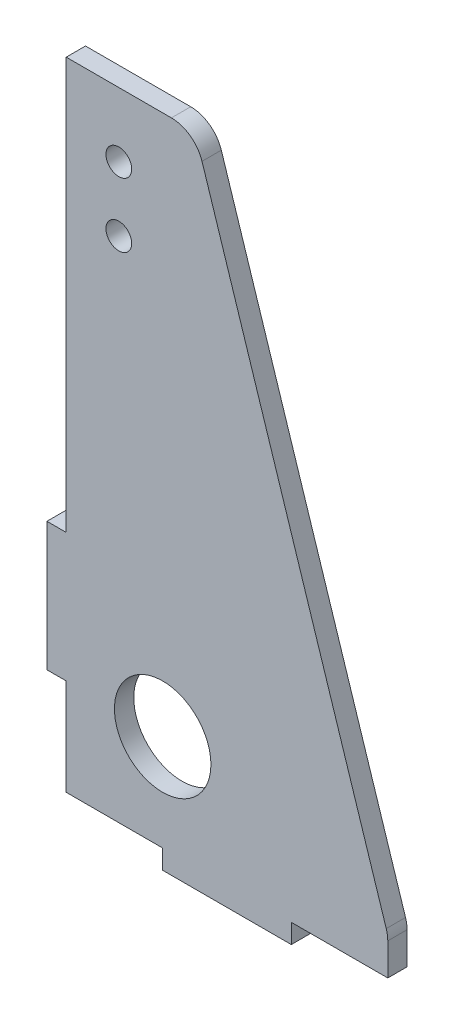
ISO-10303-21;
HEADER;
FILE_DESCRIPTION(('STEP AP214'),'2;1');
FILE_NAME('part.step','',(''),(''),'','','');
FILE_SCHEMA(('AUTOMOTIVE_DESIGN { 1 0 10303 214 1 1 1 1 }'));
ENDSEC;
DATA;
#1=APPLICATION_CONTEXT('core data for automotive mechanical design processes');
#2=APPLICATION_PROTOCOL_DEFINITION('international standard','automotive_design',2000,#1);
#3=PRODUCT_CONTEXT('',#1,'mechanical');
#4=PRODUCT('Part','Part','',(#3));
#5=PRODUCT_RELATED_PRODUCT_CATEGORY('part','',(#4));
#6=PRODUCT_DEFINITION_FORMATION('','',#4);
#7=PRODUCT_DEFINITION_CONTEXT('part definition',#1,'design');
#8=PRODUCT_DEFINITION('design','',#6,#7);
#9=PRODUCT_DEFINITION_SHAPE('','',#8);
#10=(LENGTH_UNIT() NAMED_UNIT(*) SI_UNIT(.MILLI.,.METRE.));
#11=(NAMED_UNIT(*) PLANE_ANGLE_UNIT() SI_UNIT($,.RADIAN.));
#12=(NAMED_UNIT(*) SI_UNIT($,.STERADIAN.) SOLID_ANGLE_UNIT());
#13=UNCERTAINTY_MEASURE_WITH_UNIT(LENGTH_MEASURE(1.E-05),#10,'distance_accuracy_value','');
#14=(GEOMETRIC_REPRESENTATION_CONTEXT(3) GLOBAL_UNCERTAINTY_ASSIGNED_CONTEXT((#13)) GLOBAL_UNIT_ASSIGNED_CONTEXT((#10,
#11,#12)) REPRESENTATION_CONTEXT('',''));
#15=CARTESIAN_POINT('',(0.,0.,0.));
#16=DIRECTION('',(0.,0.,1.));
#17=DIRECTION('',(1.,0.,0.));
#18=AXIS2_PLACEMENT_3D('',#15,#16,#17);
#19=CARTESIAN_POINT('',(16.3566123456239,94.,3.));
#20=DIRECTION('',(0.,0.,-1.));
#21=DIRECTION('',(-1.,0.,0.));
#22=AXIS2_PLACEMENT_3D('',#19,#20,#21);
#23=PLANE('',#22);
#24=DIRECTION('',(1.,0.,0.));
#25=VECTOR('',#24,1.);
#26=CARTESIAN_POINT('',(15.,0.,3.));
#27=LINE('',#26,#25);
#28=CARTESIAN_POINT('',(0.,0.,3.));
#29=VERTEX_POINT('',#28);
#30=CARTESIAN_POINT('',(15.,0.,3.));
#31=VERTEX_POINT('',#30);
#32=EDGE_CURVE('E201',#29,#31,#27,.T.);
#33=ORIENTED_EDGE('',*,*,#32,.T.);
#34=DIRECTION('',(0.,-1.,0.));
#35=VECTOR('',#34,1.);
#36=CARTESIAN_POINT('',(15.,0.,3.));
#37=LINE('',#36,#35);
#38=CARTESIAN_POINT('',(15.,-3.,3.));
#39=VERTEX_POINT('',#38);
#40=EDGE_CURVE('E114',#31,#39,#37,.T.);
#41=ORIENTED_EDGE('',*,*,#40,.T.);
#42=DIRECTION('',(1.,0.,0.));
#43=VECTOR('',#42,1.);
#44=CARTESIAN_POINT('',(15.,-3.,3.));
#45=LINE('',#44,#43);
#46=CARTESIAN_POINT('',(35.,-3.,3.));
#47=VERTEX_POINT('',#46);
#48=EDGE_CURVE('E237',#39,#47,#45,.T.);
#49=ORIENTED_EDGE('',*,*,#48,.T.);
#50=DIRECTION('',(0.,1.,0.));
#51=VECTOR('',#50,1.);
#52=CARTESIAN_POINT('',(35.,-3.,3.));
#53=LINE('',#52,#51);
#54=CARTESIAN_POINT('',(35.,0.,3.));
#55=VERTEX_POINT('',#54);
#56=EDGE_CURVE('E256',#47,#55,#53,.T.);
#57=ORIENTED_EDGE('',*,*,#56,.T.);
#58=DIRECTION('',(1.,0.,0.));
#59=VECTOR('',#58,1.);
#60=CARTESIAN_POINT('',(50.,0.,3.));
#61=LINE('',#60,#59);
#62=CARTESIAN_POINT('',(50.,0.,3.));
#63=VERTEX_POINT('',#62);
#64=EDGE_CURVE('E253',#55,#63,#61,.T.);
#65=ORIENTED_EDGE('',*,*,#64,.T.);
#66=DIRECTION('',(0.,1.,0.));
#67=VECTOR('',#66,1.);
#68=CARTESIAN_POINT('',(50.,5.,3.));
#69=LINE('',#68,#67);
#70=CARTESIAN_POINT('',(50.,5.,3.));
#71=VERTEX_POINT('',#70);
#72=EDGE_CURVE('E255',#63,#71,#69,.T.);
#73=ORIENTED_EDGE('',*,*,#72,.T.);
#74=CARTESIAN_POINT('',(45.,5.,3.));
#75=DIRECTION('',(0.,0.,1.));
#76=DIRECTION('',(-1.,0.,0.));
#77=AXIS2_PLACEMENT_3D('',#74,#75,#76);
#78=CIRCLE('',#77,5.);
#79=CARTESIAN_POINT('',(49.7595777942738,6.53180260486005,3.));
#80=VERTEX_POINT('',#79);
#81=EDGE_CURVE('E258',#71,#80,#78,.T.);
#82=ORIENTED_EDGE('',*,*,#81,.T.);
#83=DIRECTION('',(-0.306360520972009,0.951915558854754,0.));
#84=VECTOR('',#83,1.);
#85=CARTESIAN_POINT('',(21.1161901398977,95.53180260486,3.));
#86=LINE('',#85,#84);
#87=CARTESIAN_POINT('',(21.1161901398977,95.53180260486,3.));
#88=VERTEX_POINT('',#87);
#89=EDGE_CURVE('E264',#80,#88,#86,.T.);
#90=ORIENTED_EDGE('',*,*,#89,.T.);
#91=CARTESIAN_POINT('',(16.3566123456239,94.,3.));
#92=DIRECTION('',(0.,0.,1.));
#93=DIRECTION('',(-1.,0.,0.));
#94=AXIS2_PLACEMENT_3D('',#91,#92,#93);
#95=CIRCLE('',#94,5.00000000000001);
#96=CARTESIAN_POINT('',(16.3566123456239,99.,3.));
#97=VERTEX_POINT('',#96);
#98=EDGE_CURVE('E266',#88,#97,#95,.T.);
#99=ORIENTED_EDGE('',*,*,#98,.T.);
#100=DIRECTION('',(-1.,0.,0.));
#101=VECTOR('',#100,1.);
#102=CARTESIAN_POINT('',(0.,99.,3.));
#103=LINE('',#102,#101);
#104=CARTESIAN_POINT('',(0.,99.,3.));
#105=VERTEX_POINT('',#104);
#106=EDGE_CURVE('E268',#97,#105,#103,.T.);
#107=ORIENTED_EDGE('',*,*,#106,.T.);
#108=DIRECTION('',(0.,-1.,0.));
#109=VECTOR('',#108,1.);
#110=CARTESIAN_POINT('',(0.,35.,3.));
#111=LINE('',#110,#109);
#112=CARTESIAN_POINT('',(0.,35.,3.));
#113=VERTEX_POINT('',#112);
#114=EDGE_CURVE('E270',#105,#113,#111,.T.);
#115=ORIENTED_EDGE('',*,*,#114,.T.);
#116=DIRECTION('',(-1.,0.,0.));
#117=VECTOR('',#116,1.);
#118=CARTESIAN_POINT('',(-3.,35.,3.));
#119=LINE('',#118,#117);
#120=CARTESIAN_POINT('',(-3.,35.,3.));
#121=VERTEX_POINT('',#120);
#122=EDGE_CURVE('E154',#113,#121,#119,.T.);
#123=ORIENTED_EDGE('',*,*,#122,.T.);
#124=DIRECTION('',(0.,-1.,0.));
#125=VECTOR('',#124,1.);
#126=CARTESIAN_POINT('',(-3.,15.,3.));
#127=LINE('',#126,#125);
#128=CARTESIAN_POINT('',(-3.,15.,3.));
#129=VERTEX_POINT('',#128);
#130=EDGE_CURVE('E148',#121,#129,#127,.T.);
#131=ORIENTED_EDGE('',*,*,#130,.T.);
#132=DIRECTION('',(1.,0.,0.));
#133=VECTOR('',#132,1.);
#134=CARTESIAN_POINT('',(0.,15.,3.));
#135=LINE('',#134,#133);
#136=CARTESIAN_POINT('',(0.,15.,3.));
#137=VERTEX_POINT('',#136);
#138=EDGE_CURVE('E152',#129,#137,#135,.T.);
#139=ORIENTED_EDGE('',*,*,#138,.T.);
#140=DIRECTION('',(0.,-1.,0.));
#141=VECTOR('',#140,1.);
#142=CARTESIAN_POINT('',(0.,0.,3.));
#143=LINE('',#142,#141);
#144=EDGE_CURVE('E50',#137,#29,#143,.T.);
#145=ORIENTED_EDGE('',*,*,#144,.T.);
#146=EDGE_LOOP('',(#33,#41,#49,#57,#65,#73,#82,#90,#99,#107,#115,#123,#131,#139,#145));
#147=FACE_BOUND('',#146,.T.);
#148=CARTESIAN_POINT('',(8.17830617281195,89.,3.));
#149=DIRECTION('',(0.,0.,1.));
#150=DIRECTION('',(1.,0.,0.));
#151=AXIS2_PLACEMENT_3D('',#148,#149,#150);
#152=CIRCLE('',#151,2.);
#153=CARTESIAN_POINT('',(10.1783061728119,89.,3.));
#154=VERTEX_POINT('',#153);
#155=EDGE_CURVE('E176',#154,#154,#152,.T.);
#156=ORIENTED_EDGE('',*,*,#155,.F.);
#157=EDGE_LOOP('',(#156));
#158=FACE_BOUND('',#157,.T.);
#159=CARTESIAN_POINT('',(8.17830617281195,79.,3.));
#160=DIRECTION('',(0.,0.,1.));
#161=DIRECTION('',(1.,0.,0.));
#162=AXIS2_PLACEMENT_3D('',#159,#160,#161);
#163=CIRCLE('',#162,2.);
#164=CARTESIAN_POINT('',(10.1783061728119,79.,3.));
#165=VERTEX_POINT('',#164);
#166=EDGE_CURVE('E324',#165,#165,#163,.T.);
#167=ORIENTED_EDGE('',*,*,#166,.F.);
#168=EDGE_LOOP('',(#167));
#169=FACE_BOUND('',#168,.T.);
#170=CARTESIAN_POINT('',(15.,15.,3.));
#171=DIRECTION('',(0.,0.,1.));
#172=DIRECTION('',(1.,0.,0.));
#173=AXIS2_PLACEMENT_3D('',#170,#171,#172);
#174=CIRCLE('',#173,7.5);
#175=CARTESIAN_POINT('',(22.5,15.,3.));
#176=VERTEX_POINT('',#175);
#177=EDGE_CURVE('E315',#176,#176,#174,.T.);
#178=ORIENTED_EDGE('',*,*,#177,.F.);
#179=EDGE_LOOP('',(#178));
#180=FACE_BOUND('',#179,.T.);
#181=ADVANCED_FACE('F33',(#147,#158,#169,#180),#23,.F.);
#182=CARTESIAN_POINT('',(16.3566123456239,94.,0.));
#183=DIRECTION('',(0.,0.,-1.));
#184=DIRECTION('',(-1.,0.,0.));
#185=AXIS2_PLACEMENT_3D('',#182,#183,#184);
#186=PLANE('',#185);
#187=CARTESIAN_POINT('',(8.17830617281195,79.,0.));
#188=DIRECTION('',(0.,0.,1.));
#189=DIRECTION('',(1.,0.,0.));
#190=AXIS2_PLACEMENT_3D('',#187,#188,#189);
#191=CIRCLE('',#190,2.);
#192=CARTESIAN_POINT('',(10.1783061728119,79.,0.));
#193=VERTEX_POINT('',#192);
#194=EDGE_CURVE('E321',#193,#193,#191,.T.);
#195=ORIENTED_EDGE('',*,*,#194,.T.);
#196=EDGE_LOOP('',(#195));
#197=FACE_BOUND('',#196,.T.);
#198=DIRECTION('',(1.,0.,0.));
#199=VECTOR('',#198,1.);
#200=CARTESIAN_POINT('',(15.,0.,0.));
#201=LINE('',#200,#199);
#202=CARTESIAN_POINT('',(0.,0.,0.));
#203=VERTEX_POINT('',#202);
#204=CARTESIAN_POINT('',(15.,0.,0.));
#205=VERTEX_POINT('',#204);
#206=EDGE_CURVE('E172',#203,#205,#201,.T.);
#207=ORIENTED_EDGE('',*,*,#206,.F.);
#208=DIRECTION('',(0.,-1.,0.));
#209=VECTOR('',#208,1.);
#210=CARTESIAN_POINT('',(0.,0.,0.));
#211=LINE('',#210,#209);
#212=CARTESIAN_POINT('',(0.,15.,0.));
#213=VERTEX_POINT('',#212);
#214=EDGE_CURVE('E106',#213,#203,#211,.T.);
#215=ORIENTED_EDGE('',*,*,#214,.F.);
#216=DIRECTION('',(1.,0.,0.));
#217=VECTOR('',#216,1.);
#218=CARTESIAN_POINT('',(0.,15.,0.));
#219=LINE('',#218,#217);
#220=CARTESIAN_POINT('',(-3.,15.,0.));
#221=VERTEX_POINT('',#220);
#222=EDGE_CURVE('E100',#221,#213,#219,.T.);
#223=ORIENTED_EDGE('',*,*,#222,.F.);
#224=DIRECTION('',(0.,-1.,0.));
#225=VECTOR('',#224,1.);
#226=CARTESIAN_POINT('',(-3.,15.,0.));
#227=LINE('',#226,#225);
#228=CARTESIAN_POINT('',(-3.,35.,0.));
#229=VERTEX_POINT('',#228);
#230=EDGE_CURVE('E162',#229,#221,#227,.T.);
#231=ORIENTED_EDGE('',*,*,#230,.F.);
#232=DIRECTION('',(-1.,0.,0.));
#233=VECTOR('',#232,1.);
#234=CARTESIAN_POINT('',(-3.,35.,0.));
#235=LINE('',#234,#233);
#236=CARTESIAN_POINT('',(0.,35.,0.));
#237=VERTEX_POINT('',#236);
#238=EDGE_CURVE('E196',#237,#229,#235,.T.);
#239=ORIENTED_EDGE('',*,*,#238,.F.);
#240=DIRECTION('',(0.,-1.,0.));
#241=VECTOR('',#240,1.);
#242=CARTESIAN_POINT('',(0.,35.,0.));
#243=LINE('',#242,#241);
#244=CARTESIAN_POINT('',(0.,99.,0.));
#245=VERTEX_POINT('',#244);
#246=EDGE_CURVE('E194',#245,#237,#243,.T.);
#247=ORIENTED_EDGE('',*,*,#246,.F.);
#248=DIRECTION('',(-1.,0.,0.));
#249=VECTOR('',#248,1.);
#250=CARTESIAN_POINT('',(0.,99.,0.));
#251=LINE('',#250,#249);
#252=CARTESIAN_POINT('',(16.3566123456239,99.,0.));
#253=VERTEX_POINT('',#252);
#254=EDGE_CURVE('E192',#253,#245,#251,.T.);
#255=ORIENTED_EDGE('',*,*,#254,.F.);
#256=CARTESIAN_POINT('',(16.3566123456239,94.,0.));
#257=DIRECTION('',(0.,0.,1.));
#258=DIRECTION('',(-1.,0.,0.));
#259=AXIS2_PLACEMENT_3D('',#256,#257,#258);
#260=CIRCLE('',#259,5.00000000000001);
#261=CARTESIAN_POINT('',(21.1161901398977,95.53180260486,0.));
#262=VERTEX_POINT('',#261);
#263=EDGE_CURVE('E190',#262,#253,#260,.T.);
#264=ORIENTED_EDGE('',*,*,#263,.F.);
#265=DIRECTION('',(-0.306360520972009,0.951915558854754,0.));
#266=VECTOR('',#265,1.);
#267=CARTESIAN_POINT('',(21.1161901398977,95.53180260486,0.));
#268=LINE('',#267,#266);
#269=CARTESIAN_POINT('',(49.7595777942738,6.53180260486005,0.));
#270=VERTEX_POINT('',#269);
#271=EDGE_CURVE('E188',#270,#262,#268,.T.);
#272=ORIENTED_EDGE('',*,*,#271,.F.);
#273=CARTESIAN_POINT('',(45.,5.,0.));
#274=DIRECTION('',(0.,0.,1.));
#275=DIRECTION('',(-1.,0.,0.));
#276=AXIS2_PLACEMENT_3D('',#273,#274,#275);
#277=CIRCLE('',#276,5.);
#278=CARTESIAN_POINT('',(50.,5.,0.));
#279=VERTEX_POINT('',#278);
#280=EDGE_CURVE('E186',#279,#270,#277,.T.);
#281=ORIENTED_EDGE('',*,*,#280,.F.);
#282=DIRECTION('',(0.,1.,0.));
#283=VECTOR('',#282,1.);
#284=CARTESIAN_POINT('',(50.,5.,0.));
#285=LINE('',#284,#283);
#286=CARTESIAN_POINT('',(50.,0.,0.));
#287=VERTEX_POINT('',#286);
#288=EDGE_CURVE('E184',#287,#279,#285,.T.);
#289=ORIENTED_EDGE('',*,*,#288,.F.);
#290=DIRECTION('',(1.,0.,0.));
#291=VECTOR('',#290,1.);
#292=CARTESIAN_POINT('',(50.,0.,0.));
#293=LINE('',#292,#291);
#294=CARTESIAN_POINT('',(35.,0.,0.));
#295=VERTEX_POINT('',#294);
#296=EDGE_CURVE('E182',#295,#287,#293,.T.);
#297=ORIENTED_EDGE('',*,*,#296,.F.);
#298=DIRECTION('',(0.,1.,0.));
#299=VECTOR('',#298,1.);
#300=CARTESIAN_POINT('',(35.,-3.,0.));
#301=LINE('',#300,#299);
#302=CARTESIAN_POINT('',(35.,-3.,0.));
#303=VERTEX_POINT('',#302);
#304=EDGE_CURVE('E180',#303,#295,#301,.T.);
#305=ORIENTED_EDGE('',*,*,#304,.F.);
#306=DIRECTION('',(1.,0.,0.));
#307=VECTOR('',#306,1.);
#308=CARTESIAN_POINT('',(15.,-3.,0.));
#309=LINE('',#308,#307);
#310=CARTESIAN_POINT('',(15.,-3.,0.));
#311=VERTEX_POINT('',#310);
#312=EDGE_CURVE('E178',#311,#303,#309,.T.);
#313=ORIENTED_EDGE('',*,*,#312,.F.);
#314=DIRECTION('',(0.,-1.,0.));
#315=VECTOR('',#314,1.);
#316=CARTESIAN_POINT('',(15.,0.,0.));
#317=LINE('',#316,#315);
#318=EDGE_CURVE('E175',#205,#311,#317,.T.);
#319=ORIENTED_EDGE('',*,*,#318,.F.);
#320=EDGE_LOOP('',(#207,#215,#223,#231,#239,#247,#255,#264,#272,#281,#289,#297,#305,#313,#319));
#321=FACE_BOUND('',#320,.T.);
#322=CARTESIAN_POINT('',(8.17830617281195,89.,0.));
#323=DIRECTION('',(0.,0.,1.));
#324=DIRECTION('',(1.,0.,0.));
#325=AXIS2_PLACEMENT_3D('',#322,#323,#324);
#326=CIRCLE('',#325,2.);
#327=CARTESIAN_POINT('',(10.1783061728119,89.,0.));
#328=VERTEX_POINT('',#327);
#329=EDGE_CURVE('E327',#328,#328,#326,.T.);
#330=ORIENTED_EDGE('',*,*,#329,.T.);
#331=EDGE_LOOP('',(#330));
#332=FACE_BOUND('',#331,.T.);
#333=CARTESIAN_POINT('',(15.,15.,0.));
#334=DIRECTION('',(0.,0.,1.));
#335=DIRECTION('',(1.,0.,0.));
#336=AXIS2_PLACEMENT_3D('',#333,#334,#335);
#337=CIRCLE('',#336,7.5);
#338=CARTESIAN_POINT('',(22.5,15.,0.));
#339=VERTEX_POINT('',#338);
#340=EDGE_CURVE('E318',#339,#339,#337,.T.);
#341=ORIENTED_EDGE('',*,*,#340,.T.);
#342=EDGE_LOOP('',(#341));
#343=FACE_BOUND('',#342,.T.);
#344=ADVANCED_FACE('F241',(#197,#321,#332,#343),#186,.T.);
#345=CARTESIAN_POINT('',(15.,0.,3.));
#346=DIRECTION('',(0.,1.,0.));
#347=DIRECTION('',(-1.,0.,0.));
#348=AXIS2_PLACEMENT_3D('',#345,#346,#347);
#349=PLANE('',#348);
#350=ORIENTED_EDGE('',*,*,#206,.T.);
#351=DIRECTION('',(0.,0.,-1.));
#352=VECTOR('',#351,1.);
#353=CARTESIAN_POINT('',(15.,0.,3.));
#354=LINE('',#353,#352);
#355=EDGE_CURVE('E11',#31,#205,#354,.T.);
#356=ORIENTED_EDGE('',*,*,#355,.F.);
#357=ORIENTED_EDGE('',*,*,#32,.F.);
#358=DIRECTION('',(0.,0.,-1.));
#359=VECTOR('',#358,1.);
#360=CARTESIAN_POINT('',(0.,0.,3.));
#361=LINE('',#360,#359);
#362=EDGE_CURVE('E168',#29,#203,#361,.T.);
#363=ORIENTED_EDGE('',*,*,#362,.T.);
#364=EDGE_LOOP('',(#350,#356,#357,#363));
#365=FACE_BOUND('',#364,.T.);
#366=ADVANCED_FACE('F35',(#365),#349,.F.);
#367=CARTESIAN_POINT('',(15.,0.,3.));
#368=DIRECTION('',(1.,0.,0.));
#369=DIRECTION('',(0.,0.,-1.));
#370=AXIS2_PLACEMENT_3D('',#367,#368,#369);
#371=PLANE('',#370);
#372=ORIENTED_EDGE('',*,*,#318,.T.);
#373=DIRECTION('',(0.,0.,-1.));
#374=VECTOR('',#373,1.);
#375=CARTESIAN_POINT('',(15.,-3.,3.));
#376=LINE('',#375,#374);
#377=EDGE_CURVE('E42',#39,#311,#376,.T.);
#378=ORIENTED_EDGE('',*,*,#377,.F.);
#379=ORIENTED_EDGE('',*,*,#40,.F.);
#380=ORIENTED_EDGE('',*,*,#355,.T.);
#381=EDGE_LOOP('',(#372,#378,#379,#380));
#382=FACE_BOUND('',#381,.T.);
#383=ADVANCED_FACE('F460',(#382),#371,.F.);
#384=CARTESIAN_POINT('',(15.,-3.,3.));
#385=DIRECTION('',(0.,1.,0.));
#386=DIRECTION('',(0.,0.,1.));
#387=AXIS2_PLACEMENT_3D('',#384,#385,#386);
#388=PLANE('',#387);
#389=ORIENTED_EDGE('',*,*,#312,.T.);
#390=DIRECTION('',(0.,0.,-1.));
#391=VECTOR('',#390,1.);
#392=CARTESIAN_POINT('',(35.,-3.,3.));
#393=LINE('',#392,#391);
#394=EDGE_CURVE('E229',#47,#303,#393,.T.);
#395=ORIENTED_EDGE('',*,*,#394,.F.);
#396=ORIENTED_EDGE('',*,*,#48,.F.);
#397=ORIENTED_EDGE('',*,*,#377,.T.);
#398=EDGE_LOOP('',(#389,#395,#396,#397));
#399=FACE_BOUND('',#398,.T.);
#400=ADVANCED_FACE('F235',(#399),#388,.F.);
#401=CARTESIAN_POINT('',(35.,-3.,3.));
#402=DIRECTION('',(-1.,0.,0.));
#403=DIRECTION('',(0.,0.,1.));
#404=AXIS2_PLACEMENT_3D('',#401,#402,#403);
#405=PLANE('',#404);
#406=ORIENTED_EDGE('',*,*,#304,.T.);
#407=DIRECTION('',(0.,0.,-1.));
#408=VECTOR('',#407,1.);
#409=CARTESIAN_POINT('',(35.,0.,3.));
#410=LINE('',#409,#408);
#411=EDGE_CURVE('E226',#55,#295,#410,.T.);
#412=ORIENTED_EDGE('',*,*,#411,.F.);
#413=ORIENTED_EDGE('',*,*,#56,.F.);
#414=ORIENTED_EDGE('',*,*,#394,.T.);
#415=EDGE_LOOP('',(#406,#412,#413,#414));
#416=FACE_BOUND('',#415,.T.);
#417=ADVANCED_FACE('F247',(#416),#405,.F.);
#418=CARTESIAN_POINT('',(50.,0.,3.));
#419=DIRECTION('',(0.,1.,0.));
#420=DIRECTION('',(-1.,0.,0.));
#421=AXIS2_PLACEMENT_3D('',#418,#419,#420);
#422=PLANE('',#421);
#423=ORIENTED_EDGE('',*,*,#296,.T.);
#424=DIRECTION('',(0.,0.,-1.));
#425=VECTOR('',#424,1.);
#426=CARTESIAN_POINT('',(50.,0.,3.));
#427=LINE('',#426,#425);
#428=EDGE_CURVE('E223',#63,#287,#427,.T.);
#429=ORIENTED_EDGE('',*,*,#428,.F.);
#430=ORIENTED_EDGE('',*,*,#64,.F.);
#431=ORIENTED_EDGE('',*,*,#411,.T.);
#432=EDGE_LOOP('',(#423,#429,#430,#431));
#433=FACE_BOUND('',#432,.T.);
#434=ADVANCED_FACE('F251',(#433),#422,.F.);
#435=CARTESIAN_POINT('',(50.,5.,3.));
#436=DIRECTION('',(-1.,0.,0.));
#437=DIRECTION('',(0.,0.,1.));
#438=AXIS2_PLACEMENT_3D('',#435,#436,#437);
#439=PLANE('',#438);
#440=ORIENTED_EDGE('',*,*,#288,.T.);
#441=DIRECTION('',(0.,0.,-1.));
#442=VECTOR('',#441,1.);
#443=CARTESIAN_POINT('',(50.,5.,3.));
#444=LINE('',#443,#442);
#445=EDGE_CURVE('E220',#71,#279,#444,.T.);
#446=ORIENTED_EDGE('',*,*,#445,.F.);
#447=ORIENTED_EDGE('',*,*,#72,.F.);
#448=ORIENTED_EDGE('',*,*,#428,.T.);
#449=EDGE_LOOP('',(#440,#446,#447,#448));
#450=FACE_BOUND('',#449,.T.);
#451=ADVANCED_FACE('F425',(#450),#439,.F.);
#452=CARTESIAN_POINT('',(45.,5.,3.));
#453=DIRECTION('',(0.,0.,-1.));
#454=DIRECTION('',(-1.,0.,0.));
#455=AXIS2_PLACEMENT_3D('',#452,#453,#454);
#456=CYLINDRICAL_SURFACE('',#455,5.);
#457=ORIENTED_EDGE('',*,*,#280,.T.);
#458=DIRECTION('',(0.,0.,-1.));
#459=VECTOR('',#458,1.);
#460=CARTESIAN_POINT('',(49.7595777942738,6.53180260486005,3.));
#461=LINE('',#460,#459);
#462=EDGE_CURVE('E217',#80,#270,#461,.T.);
#463=ORIENTED_EDGE('',*,*,#462,.F.);
#464=ORIENTED_EDGE('',*,*,#81,.F.);
#465=ORIENTED_EDGE('',*,*,#445,.T.);
#466=EDGE_LOOP('',(#457,#463,#464,#465));
#467=FACE_BOUND('',#466,.T.);
#468=ADVANCED_FACE('F415',(#467),#456,.T.);
#469=CARTESIAN_POINT('',(21.1161901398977,95.53180260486,3.));
#470=DIRECTION('',(-0.951915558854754,-0.306360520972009,0.));
#471=DIRECTION('',(0.306360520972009,-0.951915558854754,0.));
#472=AXIS2_PLACEMENT_3D('',#469,#470,#471);
#473=PLANE('',#472);
#474=ORIENTED_EDGE('',*,*,#271,.T.);
#475=DIRECTION('',(0.,0.,-1.));
#476=VECTOR('',#475,1.);
#477=CARTESIAN_POINT('',(21.1161901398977,95.53180260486,3.));
#478=LINE('',#477,#476);
#479=EDGE_CURVE('E214',#88,#262,#478,.T.);
#480=ORIENTED_EDGE('',*,*,#479,.F.);
#481=ORIENTED_EDGE('',*,*,#89,.F.);
#482=ORIENTED_EDGE('',*,*,#462,.T.);
#483=EDGE_LOOP('',(#474,#480,#481,#482));
#484=FACE_BOUND('',#483,.T.);
#485=ADVANCED_FACE('F405',(#484),#473,.F.);
#486=CARTESIAN_POINT('',(16.3566123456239,94.,3.));
#487=DIRECTION('',(0.,0.,-1.));
#488=DIRECTION('',(-1.,0.,0.));
#489=AXIS2_PLACEMENT_3D('',#486,#487,#488);
#490=CYLINDRICAL_SURFACE('',#489,5.00000000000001);
#491=ORIENTED_EDGE('',*,*,#263,.T.);
#492=DIRECTION('',(0.,0.,-1.));
#493=VECTOR('',#492,1.);
#494=CARTESIAN_POINT('',(16.3566123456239,99.,3.));
#495=LINE('',#494,#493);
#496=EDGE_CURVE('E211',#97,#253,#495,.T.);
#497=ORIENTED_EDGE('',*,*,#496,.F.);
#498=ORIENTED_EDGE('',*,*,#98,.F.);
#499=ORIENTED_EDGE('',*,*,#479,.T.);
#500=EDGE_LOOP('',(#491,#497,#498,#499));
#501=FACE_BOUND('',#500,.T.);
#502=ADVANCED_FACE('F395',(#501),#490,.T.);
#503=CARTESIAN_POINT('',(0.,99.,3.));
#504=DIRECTION('',(0.,-1.,0.));
#505=DIRECTION('',(0.,0.,-1.));
#506=AXIS2_PLACEMENT_3D('',#503,#504,#505);
#507=PLANE('',#506);
#508=ORIENTED_EDGE('',*,*,#254,.T.);
#509=DIRECTION('',(0.,0.,-1.));
#510=VECTOR('',#509,1.);
#511=CARTESIAN_POINT('',(0.,99.,3.));
#512=LINE('',#511,#510);
#513=EDGE_CURVE('E208',#105,#245,#512,.T.);
#514=ORIENTED_EDGE('',*,*,#513,.F.);
#515=ORIENTED_EDGE('',*,*,#106,.F.);
#516=ORIENTED_EDGE('',*,*,#496,.T.);
#517=EDGE_LOOP('',(#508,#514,#515,#516));
#518=FACE_BOUND('',#517,.T.);
#519=ADVANCED_FACE('F386',(#518),#507,.F.);
#520=CARTESIAN_POINT('',(0.,35.,3.));
#521=DIRECTION('',(1.,0.,0.));
#522=DIRECTION('',(0.,0.,-1.));
#523=AXIS2_PLACEMENT_3D('',#520,#521,#522);
#524=PLANE('',#523);
#525=ORIENTED_EDGE('',*,*,#246,.T.);
#526=DIRECTION('',(0.,0.,-1.));
#527=VECTOR('',#526,1.);
#528=CARTESIAN_POINT('',(0.,35.,3.));
#529=LINE('',#528,#527);
#530=EDGE_CURVE('E205',#113,#237,#529,.T.);
#531=ORIENTED_EDGE('',*,*,#530,.F.);
#532=ORIENTED_EDGE('',*,*,#114,.F.);
#533=ORIENTED_EDGE('',*,*,#513,.T.);
#534=EDGE_LOOP('',(#525,#531,#532,#533));
#535=FACE_BOUND('',#534,.T.);
#536=ADVANCED_FACE('F276',(#535),#524,.F.);
#537=CARTESIAN_POINT('',(-3.,35.,3.));
#538=DIRECTION('',(0.,-1.,0.));
#539=DIRECTION('',(1.,0.,0.));
#540=AXIS2_PLACEMENT_3D('',#537,#538,#539);
#541=PLANE('',#540);
#542=ORIENTED_EDGE('',*,*,#238,.T.);
#543=DIRECTION('',(0.,0.,-1.));
#544=VECTOR('',#543,1.);
#545=CARTESIAN_POINT('',(-3.,35.,3.));
#546=LINE('',#545,#544);
#547=EDGE_CURVE('E163',#121,#229,#546,.T.);
#548=ORIENTED_EDGE('',*,*,#547,.F.);
#549=ORIENTED_EDGE('',*,*,#122,.F.);
#550=ORIENTED_EDGE('',*,*,#530,.T.);
#551=EDGE_LOOP('',(#542,#548,#549,#550));
#552=FACE_BOUND('',#551,.T.);
#553=ADVANCED_FACE('F280',(#552),#541,.F.);
#554=CARTESIAN_POINT('',(-3.,15.,3.));
#555=DIRECTION('',(1.,0.,0.));
#556=DIRECTION('',(0.,0.,-1.));
#557=AXIS2_PLACEMENT_3D('',#554,#555,#556);
#558=PLANE('',#557);
#559=ORIENTED_EDGE('',*,*,#230,.T.);
#560=DIRECTION('',(0.,0.,-1.));
#561=VECTOR('',#560,1.);
#562=CARTESIAN_POINT('',(-3.,15.,3.));
#563=LINE('',#562,#561);
#564=EDGE_CURVE('E159',#129,#221,#563,.T.);
#565=ORIENTED_EDGE('',*,*,#564,.F.);
#566=ORIENTED_EDGE('',*,*,#130,.F.);
#567=ORIENTED_EDGE('',*,*,#547,.T.);
#568=EDGE_LOOP('',(#559,#565,#566,#567));
#569=FACE_BOUND('',#568,.T.);
#570=ADVANCED_FACE('F160',(#569),#558,.F.);
#571=CARTESIAN_POINT('',(0.,15.,3.));
#572=DIRECTION('',(0.,1.,0.));
#573=DIRECTION('',(0.,0.,1.));
#574=AXIS2_PLACEMENT_3D('',#571,#572,#573);
#575=PLANE('',#574);
#576=ORIENTED_EDGE('',*,*,#222,.T.);
#577=DIRECTION('',(0.,0.,-1.));
#578=VECTOR('',#577,1.);
#579=CARTESIAN_POINT('',(0.,15.,3.));
#580=LINE('',#579,#578);
#581=EDGE_CURVE('E164',#137,#213,#580,.T.);
#582=ORIENTED_EDGE('',*,*,#581,.F.);
#583=ORIENTED_EDGE('',*,*,#138,.F.);
#584=ORIENTED_EDGE('',*,*,#564,.T.);
#585=EDGE_LOOP('',(#576,#582,#583,#584));
#586=FACE_BOUND('',#585,.T.);
#587=ADVANCED_FACE('F166',(#586),#575,.F.);
#588=CARTESIAN_POINT('',(0.,0.,3.));
#589=DIRECTION('',(1.,0.,0.));
#590=DIRECTION('',(0.,0.,-1.));
#591=AXIS2_PLACEMENT_3D('',#588,#589,#590);
#592=PLANE('',#591);
#593=ORIENTED_EDGE('',*,*,#214,.T.);
#594=ORIENTED_EDGE('',*,*,#362,.F.);
#595=ORIENTED_EDGE('',*,*,#144,.F.);
#596=ORIENTED_EDGE('',*,*,#581,.T.);
#597=EDGE_LOOP('',(#593,#594,#595,#596));
#598=FACE_BOUND('',#597,.T.);
#599=ADVANCED_FACE('F284',(#598),#592,.F.);
#600=CARTESIAN_POINT('',(8.17830617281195,89.,3.));
#601=DIRECTION('',(0.,0.,-1.));
#602=DIRECTION('',(-1.,0.,0.));
#603=AXIS2_PLACEMENT_3D('',#600,#601,#602);
#604=CYLINDRICAL_SURFACE('',#603,2.);
#605=ORIENTED_EDGE('',*,*,#155,.T.);
#606=EDGE_LOOP('',(#605));
#607=FACE_BOUND('',#606,.T.);
#608=ORIENTED_EDGE('',*,*,#329,.F.);
#609=EDGE_LOOP('',(#608));
#610=FACE_BOUND('',#609,.T.);
#611=ADVANCED_FACE('F286',(#607,#610),#604,.F.);
#612=CARTESIAN_POINT('',(8.17830617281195,79.,3.));
#613=DIRECTION('',(0.,0.,-1.));
#614=DIRECTION('',(-1.,0.,0.));
#615=AXIS2_PLACEMENT_3D('',#612,#613,#614);
#616=CYLINDRICAL_SURFACE('',#615,2.);
#617=ORIENTED_EDGE('',*,*,#166,.T.);
#618=EDGE_LOOP('',(#617));
#619=FACE_BOUND('',#618,.T.);
#620=ORIENTED_EDGE('',*,*,#194,.F.);
#621=EDGE_LOOP('',(#620));
#622=FACE_BOUND('',#621,.T.);
#623=ADVANCED_FACE('F292',(#619,#622),#616,.F.);
#624=CARTESIAN_POINT('',(15.,15.,3.));
#625=DIRECTION('',(0.,0.,-1.));
#626=DIRECTION('',(-1.,0.,0.));
#627=AXIS2_PLACEMENT_3D('',#624,#625,#626);
#628=CYLINDRICAL_SURFACE('',#627,7.5);
#629=ORIENTED_EDGE('',*,*,#177,.T.);
#630=EDGE_LOOP('',(#629));
#631=FACE_BOUND('',#630,.T.);
#632=ORIENTED_EDGE('',*,*,#340,.F.);
#633=EDGE_LOOP('',(#632));
#634=FACE_BOUND('',#633,.T.);
#635=ADVANCED_FACE('F306',(#631,#634),#628,.F.);
#636=CLOSED_SHELL('',(#181,#344,#366,#383,#400,#417,#434,#451,#468,#485,#502,#519,#536,#553,
#570,#587,#599,#611,#623,#635));
#637=MANIFOLD_SOLID_BREP('B2',#636);
#638=ADVANCED_BREP_SHAPE_REPRESENTATION('',(#18,#637),#14);
#639=SHAPE_DEFINITION_REPRESENTATION(#9,#638);
ENDSEC;
END-ISO-10303-21;
